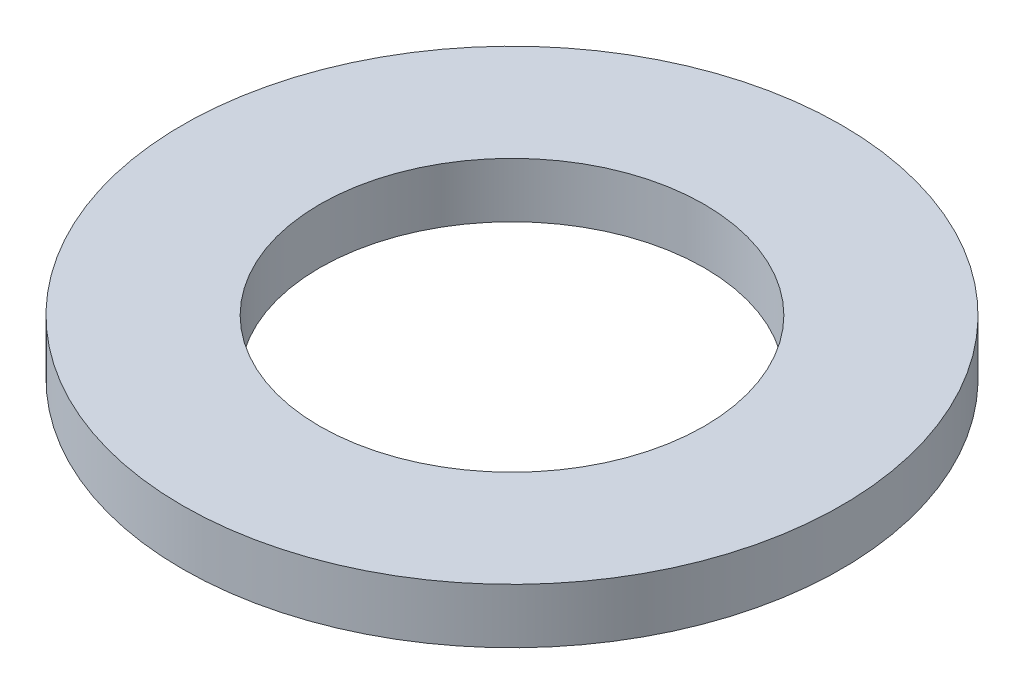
from build123d import *

# Parameters (mm, degrees)
SKETCH1_R      = 60
SKETCH1_R_2    = 35
EXTRUDE1_DEPTH = 10


with BuildPart() as part:
    # Sketch1 → Extrude1 (new body)
    with BuildSketch(Plane(origin=(0, 0, 0), x_dir=(1, 0, 0), z_dir=(0, 1, 0))):
        with Locations(Location((0, 0, 0), (0, 0, 270))):
            Circle(SKETCH1_R)
        with Locations(Location((0, 0, 0), (0, 0, 270))):
            Circle(SKETCH1_R_2, mode=Mode.SUBTRACT)
    extrude(amount=EXTRUDE1_DEPTH)


solid = part.part
